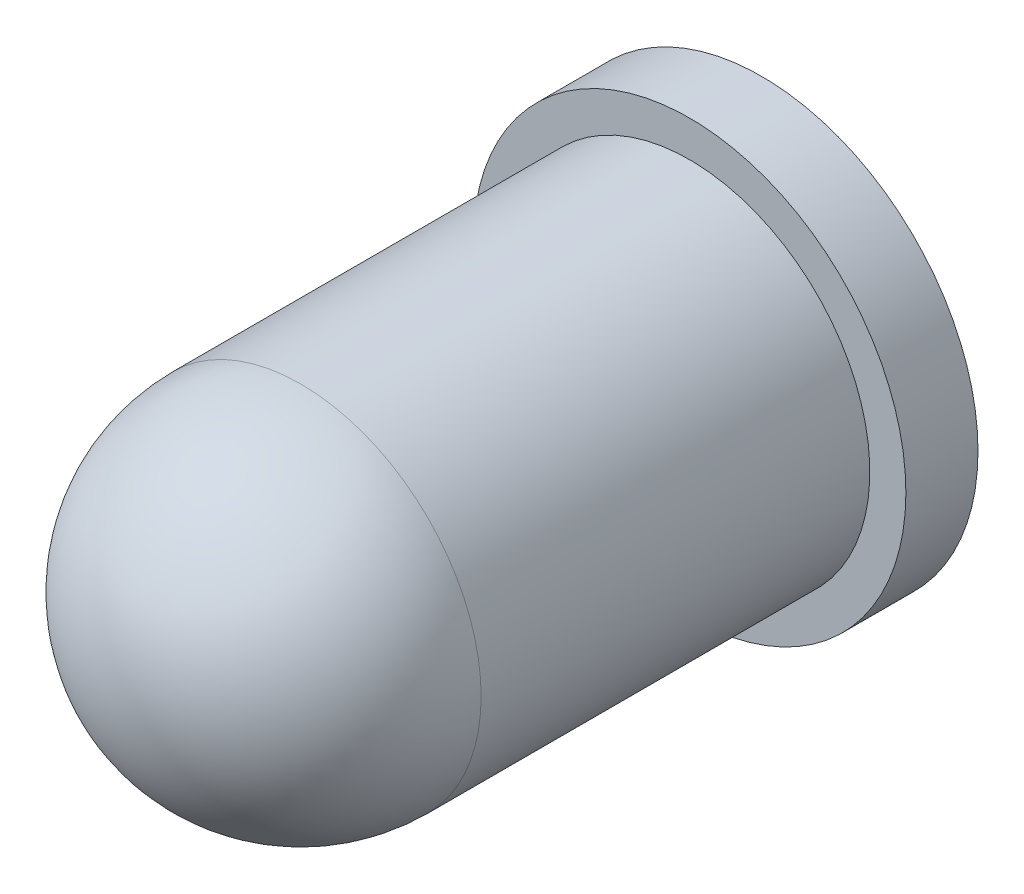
ISO-10303-21;
HEADER;
FILE_DESCRIPTION(('STEP AP214'),'2;1');
FILE_NAME('part.step','',(''),(''),'','','');
FILE_SCHEMA(('AUTOMOTIVE_DESIGN { 1 0 10303 214 1 1 1 1 }'));
ENDSEC;
DATA;
#1=APPLICATION_CONTEXT('core data for automotive mechanical design processes');
#2=APPLICATION_PROTOCOL_DEFINITION('international standard','automotive_design',2000,#1);
#3=PRODUCT_CONTEXT('',#1,'mechanical');
#4=PRODUCT('Part','Part','',(#3));
#5=PRODUCT_RELATED_PRODUCT_CATEGORY('part','',(#4));
#6=PRODUCT_DEFINITION_FORMATION('','',#4);
#7=PRODUCT_DEFINITION_CONTEXT('part definition',#1,'design');
#8=PRODUCT_DEFINITION('design','',#6,#7);
#9=PRODUCT_DEFINITION_SHAPE('','',#8);
#10=(LENGTH_UNIT() NAMED_UNIT(*) SI_UNIT(.MILLI.,.METRE.));
#11=(NAMED_UNIT(*) PLANE_ANGLE_UNIT() SI_UNIT($,.RADIAN.));
#12=(NAMED_UNIT(*) SI_UNIT($,.STERADIAN.) SOLID_ANGLE_UNIT());
#13=UNCERTAINTY_MEASURE_WITH_UNIT(LENGTH_MEASURE(1.E-05),#10,'distance_accuracy_value','');
#14=(GEOMETRIC_REPRESENTATION_CONTEXT(3) GLOBAL_UNCERTAINTY_ASSIGNED_CONTEXT((#13)) GLOBAL_UNIT_ASSIGNED_CONTEXT((#10,
#11,#12)) REPRESENTATION_CONTEXT('',''));
#15=CARTESIAN_POINT('',(0.,0.,0.));
#16=DIRECTION('',(0.,0.,1.));
#17=DIRECTION('',(1.,0.,0.));
#18=AXIS2_PLACEMENT_3D('',#15,#16,#17);
#19=CARTESIAN_POINT('',(0.,0.,0.));
#20=DIRECTION('',(0.,0.,-1.));
#21=DIRECTION('',(-1.,0.,0.));
#22=AXIS2_PLACEMENT_3D('',#19,#20,#21);
#23=CYLINDRICAL_SURFACE('',#22,3.);
#24=CARTESIAN_POINT('',(0.,0.,1.));
#25=DIRECTION('',(0.,0.,-1.));
#26=DIRECTION('',(-1.,0.,0.));
#27=AXIS2_PLACEMENT_3D('',#24,#25,#26);
#28=CIRCLE('',#27,3.);
#29=CARTESIAN_POINT('',(-3.,0.,1.));
#30=VERTEX_POINT('',#29);
#31=EDGE_CURVE('E10',#30,#30,#28,.T.);
#32=ORIENTED_EDGE('',*,*,#31,.T.);
#33=EDGE_LOOP('',(#32));
#34=FACE_BOUND('',#33,.T.);
#35=CARTESIAN_POINT('',(0.,0.,0.));
#36=DIRECTION('',(0.,0.,-1.));
#37=DIRECTION('',(-1.,0.,0.));
#38=AXIS2_PLACEMENT_3D('',#35,#36,#37);
#39=CIRCLE('',#38,3.);
#40=CARTESIAN_POINT('',(-3.,0.,0.));
#41=VERTEX_POINT('',#40);
#42=EDGE_CURVE('E42',#41,#41,#39,.T.);
#43=ORIENTED_EDGE('',*,*,#42,.F.);
#44=EDGE_LOOP('',(#43));
#45=FACE_BOUND('',#44,.T.);
#46=ADVANCED_FACE('F28',(#34,#45),#23,.T.);
#47=CARTESIAN_POINT('',(0.,3.,1.));
#48=DIRECTION('',(0.,0.,1.));
#49=DIRECTION('',(1.,0.,0.));
#50=AXIS2_PLACEMENT_3D('',#47,#48,#49);
#51=PLANE('',#50);
#52=CARTESIAN_POINT('',(0.,0.,1.));
#53=DIRECTION('',(0.,0.,-1.));
#54=DIRECTION('',(-1.,0.,0.));
#55=AXIS2_PLACEMENT_3D('',#52,#53,#54);
#56=CIRCLE('',#55,2.5);
#57=CARTESIAN_POINT('',(-2.5,0.,1.));
#58=VERTEX_POINT('',#57);
#59=EDGE_CURVE('E34',#58,#58,#56,.T.);
#60=ORIENTED_EDGE('',*,*,#59,.T.);
#61=EDGE_LOOP('',(#60));
#62=FACE_BOUND('',#61,.T.);
#63=ORIENTED_EDGE('',*,*,#31,.F.);
#64=EDGE_LOOP('',(#63));
#65=FACE_BOUND('',#64,.T.);
#66=ADVANCED_FACE('F51',(#62,#65),#51,.T.);
#67=CARTESIAN_POINT('',(0.,0.,0.));
#68=DIRECTION('',(0.,0.,-1.));
#69=DIRECTION('',(-1.,0.,0.));
#70=AXIS2_PLACEMENT_3D('',#67,#68,#69);
#71=CYLINDRICAL_SURFACE('',#70,2.5);
#72=CARTESIAN_POINT('',(0.,0.,6.39));
#73=DIRECTION('',(0.,0.,-1.));
#74=DIRECTION('',(-1.,0.,0.));
#75=AXIS2_PLACEMENT_3D('',#72,#73,#74);
#76=CIRCLE('',#75,2.5);
#77=CARTESIAN_POINT('',(-2.5,0.,6.39));
#78=VERTEX_POINT('',#77);
#79=EDGE_CURVE('E38',#78,#78,#76,.T.);
#80=ORIENTED_EDGE('',*,*,#79,.T.);
#81=EDGE_LOOP('',(#80));
#82=FACE_BOUND('',#81,.T.);
#83=ORIENTED_EDGE('',*,*,#59,.F.);
#84=EDGE_LOOP('',(#83));
#85=FACE_BOUND('',#84,.T.);
#86=ADVANCED_FACE('F55',(#82,#85),#71,.T.);
#87=CARTESIAN_POINT('',(0.,0.,6.39));
#88=DIRECTION('',(0.,0.,-1.));
#89=DIRECTION('',(0.,1.,0.));
#90=AXIS2_PLACEMENT_3D('',#87,#88,#89);
#91=SPHERICAL_SURFACE('',#90,2.5);
#92=ORIENTED_EDGE('',*,*,#79,.F.);
#93=EDGE_LOOP('',(#92));
#94=FACE_BOUND('',#93,.T.);
#95=ADVANCED_FACE('F59',(#94),#91,.T.);
#96=CARTESIAN_POINT('',(0.,0.,0.));
#97=DIRECTION('',(0.,0.,-1.));
#98=DIRECTION('',(-1.,0.,0.));
#99=AXIS2_PLACEMENT_3D('',#96,#97,#98);
#100=PLANE('',#99);
#101=ORIENTED_EDGE('',*,*,#42,.T.);
#102=EDGE_LOOP('',(#101));
#103=FACE_BOUND('',#102,.T.);
#104=ADVANCED_FACE('F48',(#103),#100,.T.);
#105=CLOSED_SHELL('',(#46,#66,#86,#95,#104));
#106=MANIFOLD_SOLID_BREP('B2',#105);
#107=ADVANCED_BREP_SHAPE_REPRESENTATION('',(#18,#106),#14);
#108=SHAPE_DEFINITION_REPRESENTATION(#9,#107);
ENDSEC;
END-ISO-10303-21;
